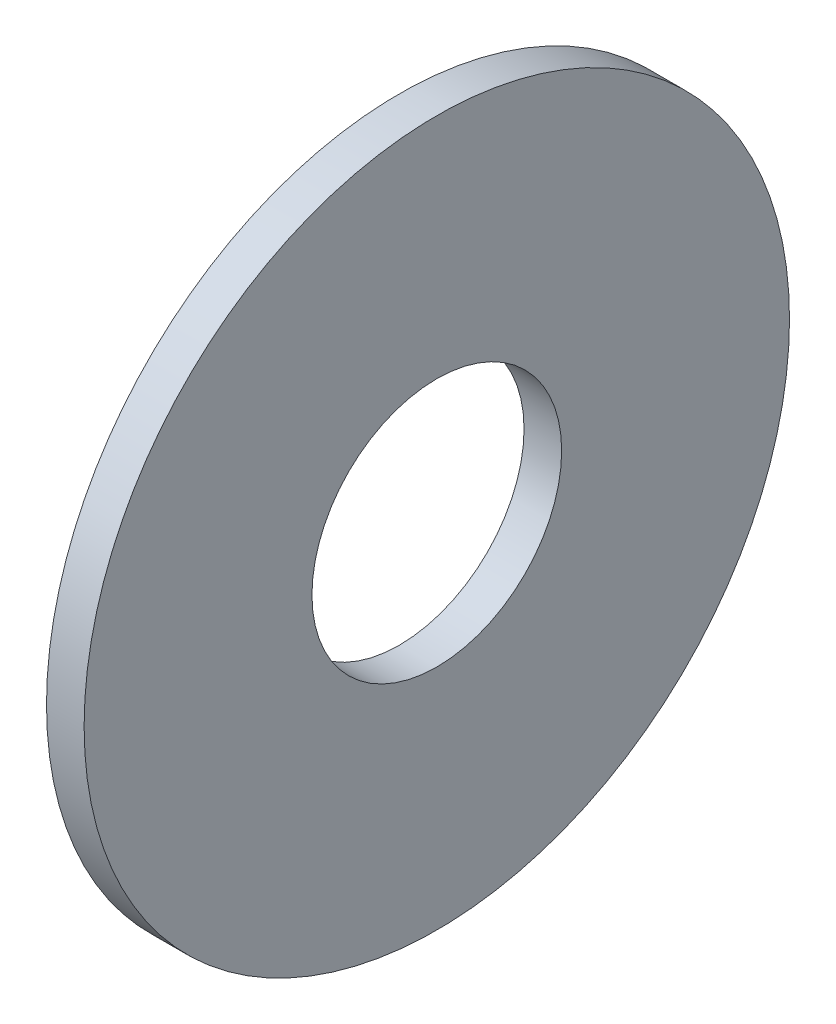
from build123d import *

# Parameters (mm, degrees)
SKETCH1_W = 4.064
SKETCH1_H = 24.6126


with BuildPart() as part:
    # Sketch1 → Base-Revolve (revolve)
    with BuildSketch(Plane.XY, mode=Mode.PRIVATE) as base_revolve_sk:
        with Locations((-2.032, 25.7937)):
            Rectangle(SKETCH1_W, SKETCH1_H)
    revolve(base_revolve_sk.sketch.rotate(Axis((-34.925, 0, 0), (1, 0, 0)), 90), axis=Axis((-34.925, 0, 0), (1, 0, 0)))


solid = part.part
